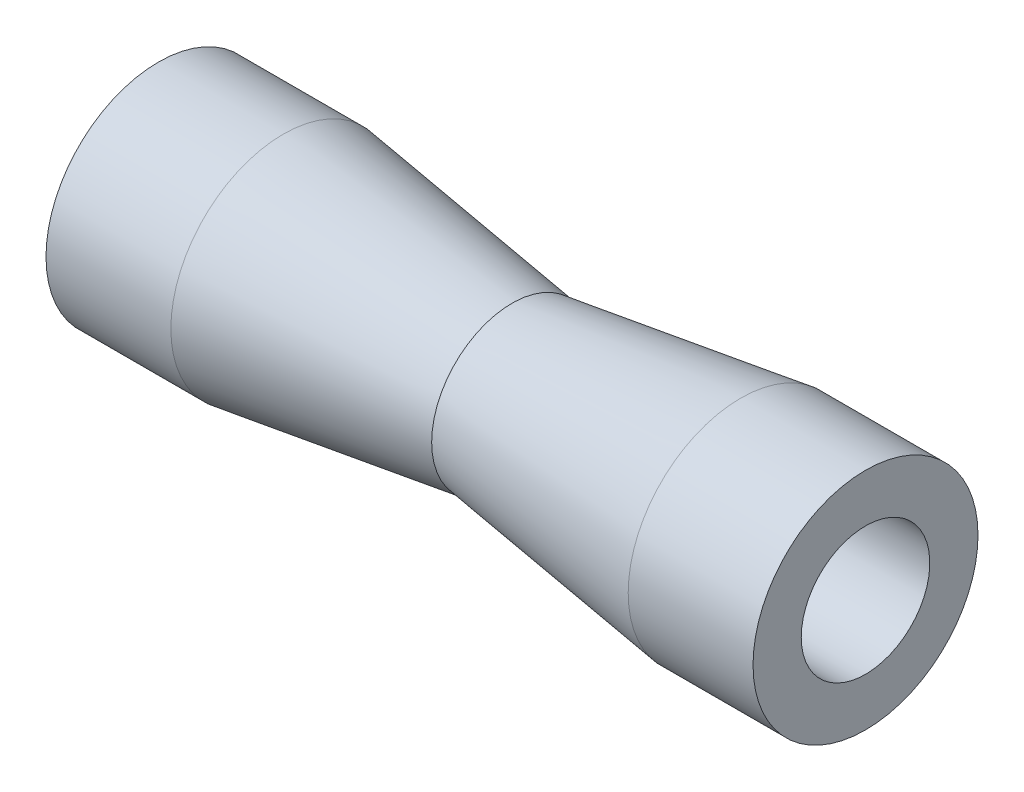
from build123d import *


with BuildPart() as part:
    # Sketch1 → Revolve1 (revolve)
    with BuildSketch(Plane.XY, mode=Mode.PRIVATE) as revolve1_sk:
        Polygon((0, 6.35), (69.85, 6.35), (69.85, 11.1125), (57.516298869, 11.1125), (34.925, 7.9375), (12.333701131, 11.1125), (0, 11.1125), align=None)
    revolve(revolve1_sk.sketch.rotate(Axis((0, 0, 0), (1, 0, 0)), 90), axis=Axis((0, 0, 0), (1, 0, 0)))


solid = part.part
